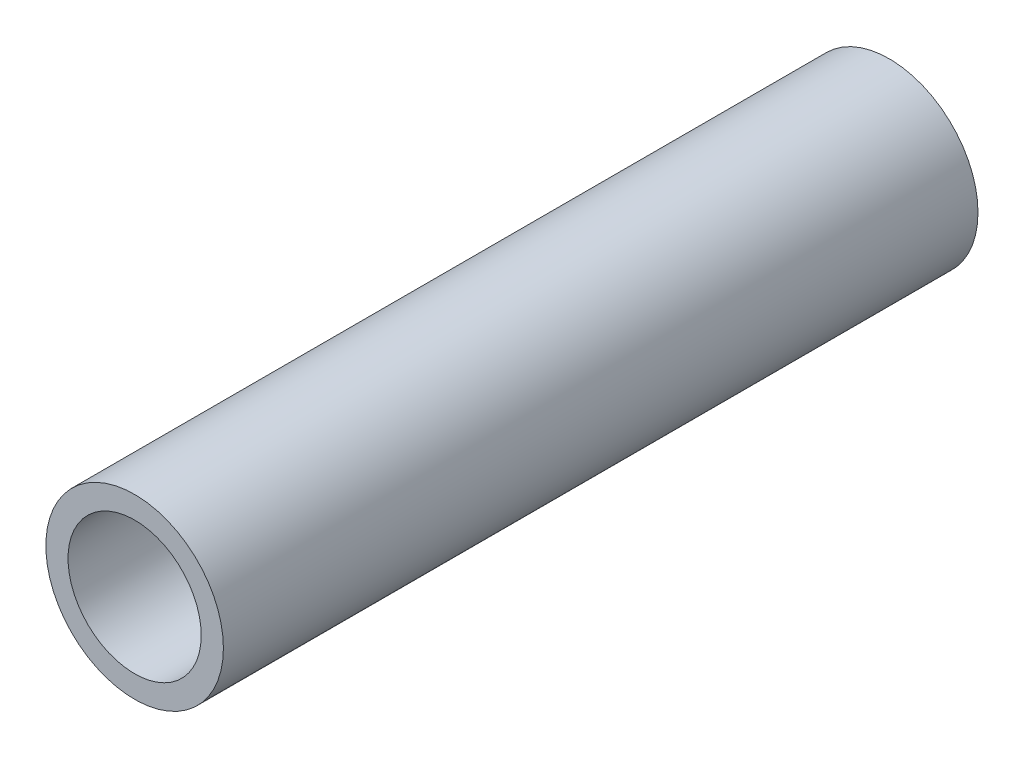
from build123d import *

# Parameters (mm, degrees)
ESQUISSE1_R      = 4
ESQUISSE1_R_2    = 3
EXTRUSION1_DEPTH = 34


with BuildPart() as part:
    # Esquisse1 → Extrusion1 (new body)
    with BuildSketch(Plane.XY):
        Circle(ESQUISSE1_R)
        Circle(ESQUISSE1_R_2, mode=Mode.SUBTRACT)
    extrude(amount=EXTRUSION1_DEPTH)


solid = part.part
